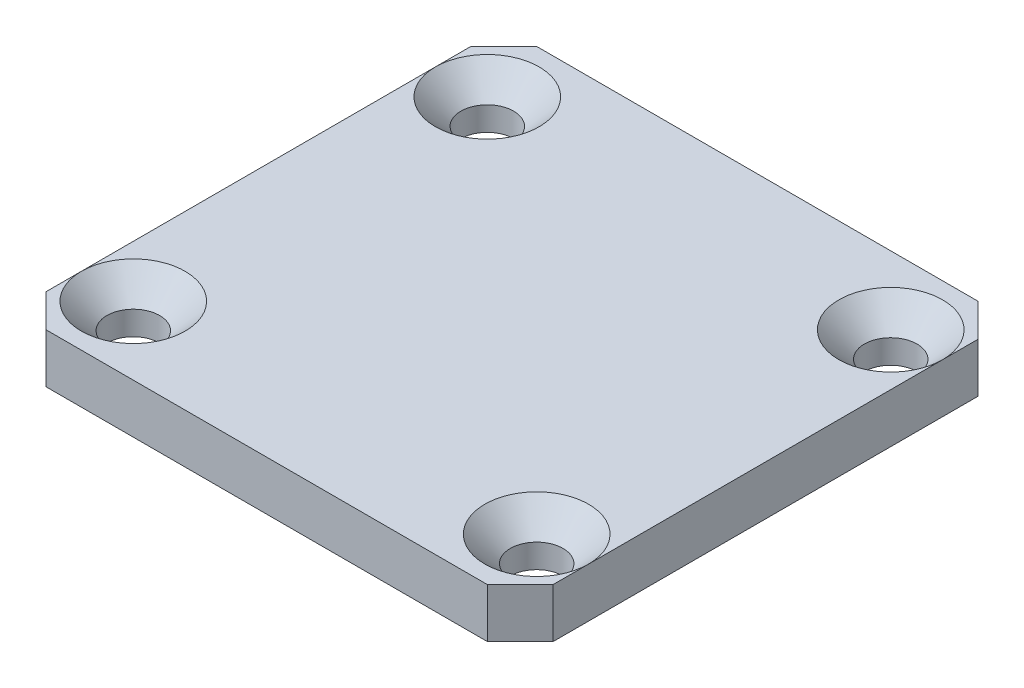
from build123d import *

# Parameters (mm, degrees)
SKETCH1_W            = 30.8
SKETCH1_H            = 29.8
BOSS_EXTRUDE1_DEPTH  = 3
CHAMFER1_SIZE        = 2
LPATTERN1_COUNT      = 2
LPATTERN1_PITCH      = 24.5
LPATTERN1_COUNT_DIR2 = 2
LPATTERN1_PITCH_DIR2 = 21.5


with BuildPart() as part:
    # Sketch1 → Boss-Extrude1 (new body)
    with BuildSketch(Plane(origin=(0, 0, 0), x_dir=(1, 0, 0), z_dir=(0, 1, 0))):
        Rectangle(SKETCH1_W, SKETCH1_H)
    extrude(amount=BOSS_EXTRUDE1_DEPTH)

    # Chamfer1
    chamfer1_edges = [part.edges().sort_by_distance(p)[0] for p in [
        (-15.4, 1.5, -14.9),
        (15.4, 1.5, -14.9),
        (15.4, 1.5, 14.9),
        (-15.4, 1.5, 14.9),
    ]]
    chamfer(chamfer1_edges, length=CHAMFER1_SIZE)

    # Sketch10 → CSK for M3 Flat Head Machine Screw1 (revolve, cut)
    with BuildSketch(Plane(origin=(-12.25, 3, 10.75), x_dir=(0, 0, 1), z_dir=(1, 0, 0))):
        Polygon((0, 0), (0, 3), (1.6, 3), (1.6, 1.55), (3.15, 0), align=None)
    csk_for_m3_flat_head_machine_screw1 = revolve(axis=Axis((-12.25, 9.35, 10.75), (0, -1, 0)), mode=Mode.SUBTRACT)

    # LPattern1: CSK for M3 Flat Head Machine Screw1 2 × 2
    with Locations(*[(i * LPATTERN1_PITCH, 0, -j * LPATTERN1_PITCH_DIR2) for i in range(LPATTERN1_COUNT) for j in range(LPATTERN1_COUNT_DIR2) if (i, j) != (0, 0)]):
        add(csk_for_m3_flat_head_machine_screw1, mode=Mode.SUBTRACT)


solid = part.part
